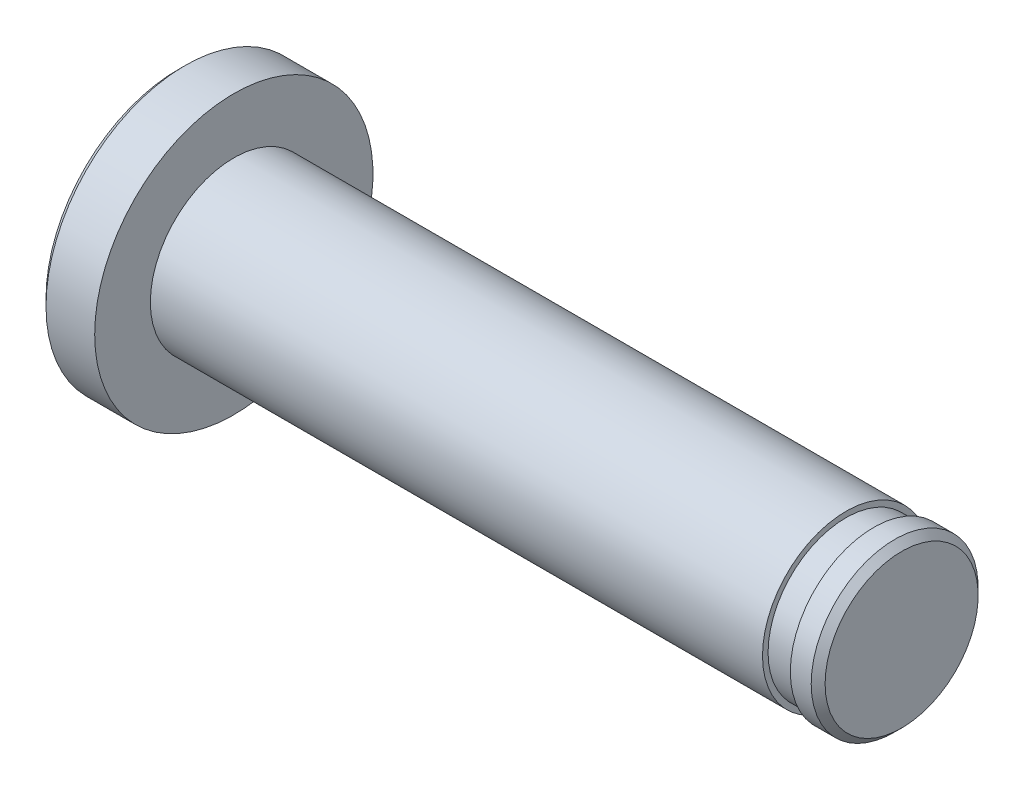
from build123d import *


with BuildPart() as part:
    # Esquisse1 → Base-R_volution (revolve)
    with BuildSketch(Plane.XY, mode=Mode.PRIVATE) as base_r_volution_sk:
        Polygon((-2, 0), (-2, 4.75), (-1.75, 5), (0, 5), (0, 3), (22, 3), (22, 2.8), (23, 2.8), (23, 3), (23.75, 3), (24, 2.75), (24, 0), align=None)
    revolve(base_r_volution_sk.sketch.rotate(Axis((0, 0, 0), (1, 0, 0)), 90), axis=Axis((0, 0, 0), (1, 0, 0)))


solid = part.part
